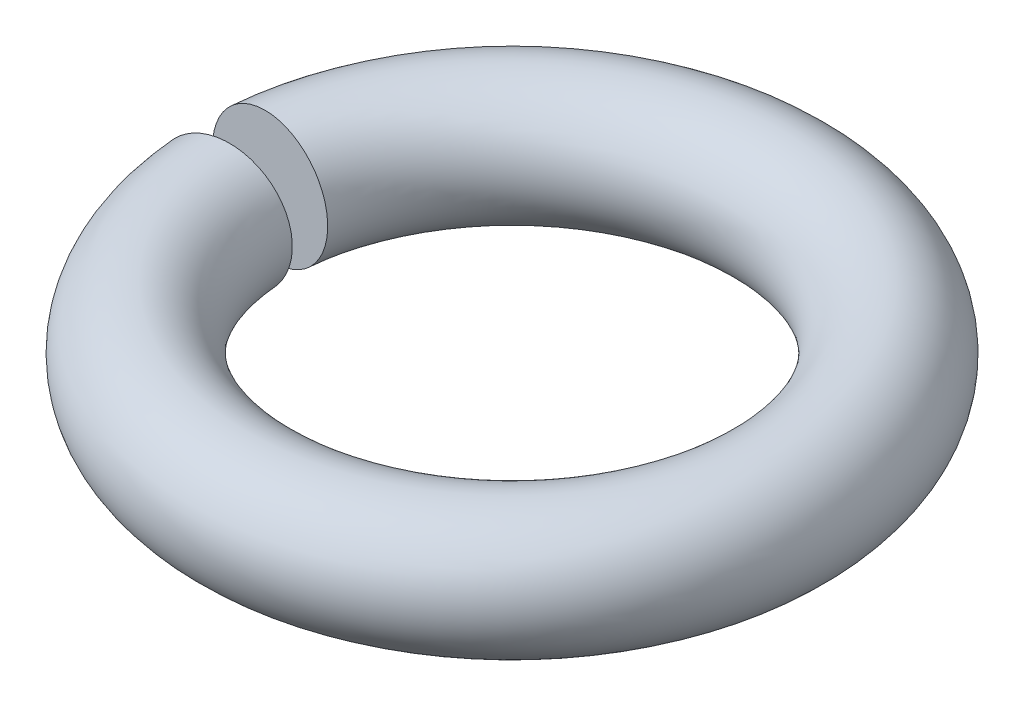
ISO-10303-21;
HEADER;
FILE_DESCRIPTION(('STEP AP214'),'2;1');
FILE_NAME('part.step','',(''),(''),'','','');
FILE_SCHEMA(('AUTOMOTIVE_DESIGN { 1 0 10303 214 1 1 1 1 }'));
ENDSEC;
DATA;
#1=APPLICATION_CONTEXT('core data for automotive mechanical design processes');
#2=APPLICATION_PROTOCOL_DEFINITION('international standard','automotive_design',2000,#1);
#3=PRODUCT_CONTEXT('',#1,'mechanical');
#4=PRODUCT('Part','Part','',(#3));
#5=PRODUCT_RELATED_PRODUCT_CATEGORY('part','',(#4));
#6=PRODUCT_DEFINITION_FORMATION('','',#4);
#7=PRODUCT_DEFINITION_CONTEXT('part definition',#1,'design');
#8=PRODUCT_DEFINITION('design','',#6,#7);
#9=PRODUCT_DEFINITION_SHAPE('','',#8);
#10=(LENGTH_UNIT() NAMED_UNIT(*) SI_UNIT(.MILLI.,.METRE.));
#11=(NAMED_UNIT(*) PLANE_ANGLE_UNIT() SI_UNIT($,.RADIAN.));
#12=(NAMED_UNIT(*) SI_UNIT($,.STERADIAN.) SOLID_ANGLE_UNIT());
#13=UNCERTAINTY_MEASURE_WITH_UNIT(LENGTH_MEASURE(1.E-05),#10,'distance_accuracy_value','');
#14=(GEOMETRIC_REPRESENTATION_CONTEXT(3) GLOBAL_UNCERTAINTY_ASSIGNED_CONTEXT((#13)) GLOBAL_UNIT_ASSIGNED_CONTEXT((#10,
#11,#12)) REPRESENTATION_CONTEXT('',''));
#15=CARTESIAN_POINT('',(0.,0.,0.));
#16=DIRECTION('',(0.,0.,1.));
#17=DIRECTION('',(1.,0.,0.));
#18=AXIS2_PLACEMENT_3D('',#15,#16,#17);
#19=CARTESIAN_POINT('',(0.,-0.522439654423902,0.));
#20=DIRECTION('',(0.,1.,0.));
#21=DIRECTION('',(0.,0.,1.));
#22=AXIS2_PLACEMENT_3D('',#19,#20,#21);
#23=TOROIDAL_SURFACE('',#22,5.25000000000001,1.25);
#24=CARTESIAN_POINT('',(-5.23002216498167,-0.522439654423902,0.457567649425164));
#25=DIRECTION('',(-0.0871557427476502,0.,-0.996194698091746));
#26=DIRECTION('',(-0.996194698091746,0.,0.0871557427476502));
#27=AXIS2_PLACEMENT_3D('',#24,#25,#26);
#28=CIRCLE('',#27,1.25);
#29=CARTESIAN_POINT('',(-6.47526553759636,-0.522439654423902,0.566512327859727));
#30=VERTEX_POINT('',#29);
#31=EDGE_CURVE('E10',#30,#30,#28,.T.);
#32=CARTESIAN_POINT('',(-5.23002216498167,-0.522439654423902,-0.457567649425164));
#33=DIRECTION('',(0.0871557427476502,0.,-0.996194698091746));
#34=DIRECTION('',(-0.996194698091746,0.,-0.0871557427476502));
#35=AXIS2_PLACEMENT_3D('',#32,#33,#34);
#36=CIRCLE('',#35,1.25);
#37=CARTESIAN_POINT('',(-6.47526553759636,-0.522439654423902,-0.566512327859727));
#38=VERTEX_POINT('',#37);
#39=EDGE_CURVE('E34',#38,#38,#36,.T.);
#40=CARTESIAN_POINT('',(0.,-0.522439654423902,0.));
#41=DIRECTION('',(0.,1.,0.));
#42=DIRECTION('',(0.,0.,1.));
#43=AXIS2_PLACEMENT_3D('',#40,#41,#42);
#44=CIRCLE('',#43,6.50000000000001);
#45=EDGE_CURVE('',#30,#38,#44,.T.);
#46=ORIENTED_EDGE('',*,*,#31,.F.);
#47=ORIENTED_EDGE('',*,*,#39,.T.);
#48=ORIENTED_EDGE('',*,*,#45,.T.);
#49=ORIENTED_EDGE('',*,*,#45,.F.);
#50=EDGE_LOOP('',(#46,#48,#47,#49));
#51=FACE_BOUND('',#50,.T.);
#52=ADVANCED_FACE('F28',(#51),#23,.T.);
#53=CARTESIAN_POINT('',(-5.23002216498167,-0.522439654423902,0.457567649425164));
#54=DIRECTION('',(-0.0871557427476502,0.,-0.996194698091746));
#55=DIRECTION('',(-0.996194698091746,0.,0.0871557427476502));
#56=AXIS2_PLACEMENT_3D('',#53,#54,#55);
#57=PLANE('',#56);
#58=ORIENTED_EDGE('',*,*,#31,.T.);
#59=EDGE_LOOP('',(#58));
#60=FACE_BOUND('',#59,.T.);
#61=ADVANCED_FACE('F43',(#60),#57,.T.);
#62=CARTESIAN_POINT('',(-5.23002216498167,-0.522439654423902,-0.457567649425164));
#63=DIRECTION('',(0.0871557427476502,0.,-0.996194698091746));
#64=DIRECTION('',(-0.996194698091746,0.,-0.0871557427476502));
#65=AXIS2_PLACEMENT_3D('',#62,#63,#64);
#66=PLANE('',#65);
#67=ORIENTED_EDGE('',*,*,#39,.F.);
#68=EDGE_LOOP('',(#67));
#69=FACE_BOUND('',#68,.T.);
#70=ADVANCED_FACE('F41',(#69),#66,.F.);
#71=CLOSED_SHELL('',(#52,#61,#70));
#72=MANIFOLD_SOLID_BREP('B2',#71);
#73=ADVANCED_BREP_SHAPE_REPRESENTATION('',(#18,#72),#14);
#74=SHAPE_DEFINITION_REPRESENTATION(#9,#73);
ENDSEC;
END-ISO-10303-21;
